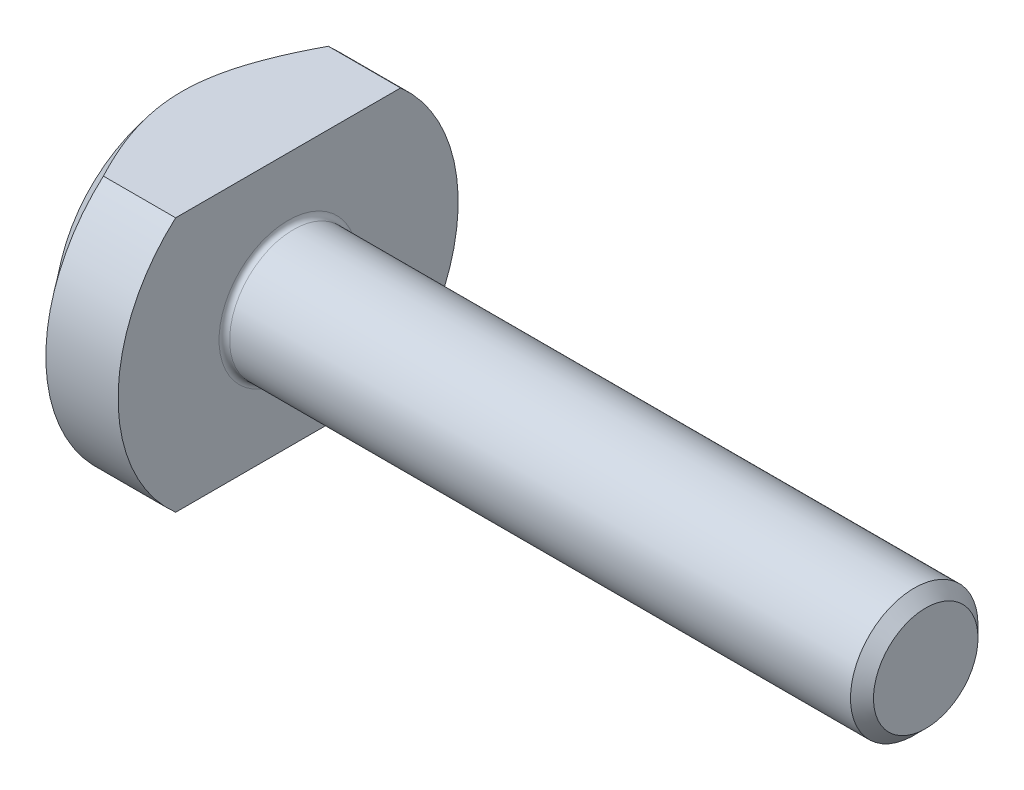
from build123d import *

# Parameters (mm, degrees)
CUT_EXTRUDE1_DEPTH = 13.468263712
SKETCH3_R          = 3
BASEBODY_DEPTH     = 30
HEADFILLET_R       = 0.25
CHAMFER1_SIZE      = 0.5415


with BuildPart() as part:
    # Sketch1 → BaseHead (revolve)
    with BuildSketch(Plane(origin=(-1.517592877, 0, -6.482407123), x_dir=(0, 0, -1), z_dir=(0, 1, 0))):
        Polygon((-6.482407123, -1.517592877), (-14.482407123, -1.517592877), (-14.482407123, 1.882407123), (-12.182407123, 3.722407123), (-6.482407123, 3.722407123), align=None)
    revolve(axis=Axis((-7.391301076, 0, 0), (1, 0, 0)))

    # Sketch2 → Cut-Extrude1 (cut, through all)
    with BuildSketch(Plane(origin=(0, 0, 0), x_dir=(0, 0, -1), z_dir=(1, 0, 0))):
        with BuildLine():
            Line((5.291502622, 6), (-5.291502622, 6))
            ThreePointArc((-5.291502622, 6), (0, 8), (5.291502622, 6))
        make_face()
        with BuildLine():
            Line((5.291502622, -6), (-5.291502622, -6))
            ThreePointArc((-5.291502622, -6), (0, -8), (5.291502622, -6))
        make_face()
    extrude(amount=-CUT_EXTRUDE1_DEPTH, mode=Mode.SUBTRACT)

    # Sketch3 → BaseBody (add)
    with BuildSketch(Plane(origin=(0, -0.725422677, 3.536967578), x_dir=(0, 0, -1), z_dir=(1, 0, 0))):
        with Locations((3.536967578, 0.725422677)):
            Circle(SKETCH3_R)
    extrude(amount=BASEBODY_DEPTH)

    # HeadFillet
    headfillet_edges = [part.edges().sort_by_distance(p)[0] for p in [
        (0, 0, 3),
    ]]
    fillet(headfillet_edges, radius=HEADFILLET_R)

    # Chamfer1
    chamfer1_edges = [part.edges().sort_by_distance(p)[0] for p in [
        (30, 0, 3),
    ]]
    chamfer(chamfer1_edges, length=CHAMFER1_SIZE)


solid = part.part
